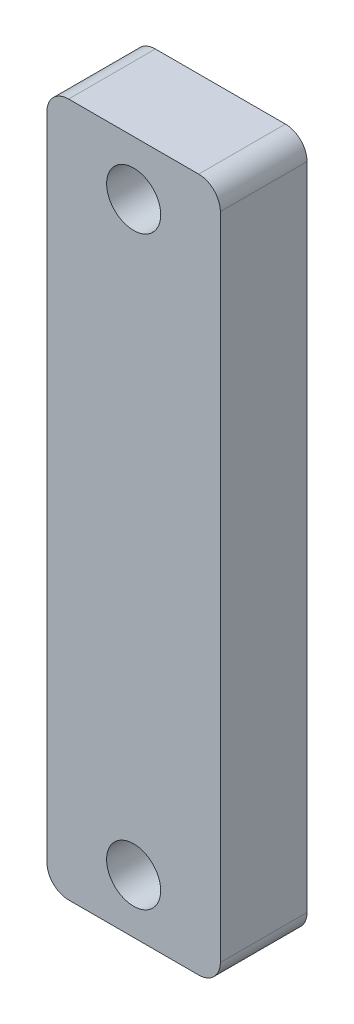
from build123d import *

# Parameters (mm, degrees)
SKETCH1_W           = 25.4
SKETCH1_H           = 101.6
SKETCH1_R           = 3.9624
BOSS_EXTRUDE1_DEPTH = 12.7
FILLET1_R           = 3.175


with BuildPart() as part:
    # Sketch1 → Boss-Extrude1 (new body)
    with BuildSketch(Plane.XY):
        with Locations((12.7, 50.8)):
            Rectangle(SKETCH1_W, SKETCH1_H)
        with Locations((12.7, 7.9248)):
            Circle(SKETCH1_R, mode=Mode.SUBTRACT)
        with Locations((12.7, 93.6498)):
            Circle(SKETCH1_R, mode=Mode.SUBTRACT)
    extrude(amount=BOSS_EXTRUDE1_DEPTH)

    # Fillet1
    fillet1_edges = [part.edges().sort_by_distance(p)[0] for p in [
        (0, 101.6, 6.35),
        (25.4, 101.6, 6.35),
        (25.4, 0, 6.35),
        (0, 0, 6.35),
    ]]
    fillet(fillet1_edges, radius=FILLET1_R)


solid = part.part
